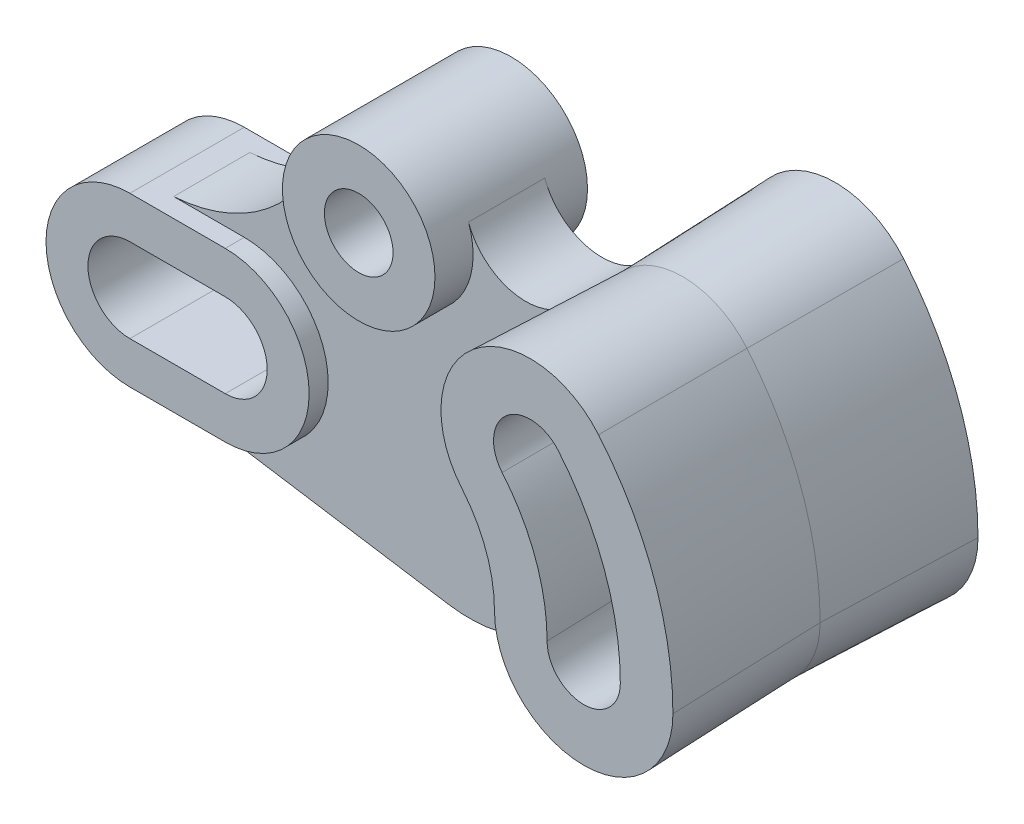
from build123d import *

# Parameters (mm, degrees)
EXTRUDE1_DEPTH           = 10
EXTRUDE2_DEPTH           = 15
SKETCH1_4_R              = 20.00000000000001
SKETCH1_4_R_2            = 9.000000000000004
EXTRUDE3_DEPTH           = 20
EXTRUDE4_DEPTH           = 40
EXTRUDE4_TAPER           = -2.0000000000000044
EXTRUDE4_OTHER_WAY_DEPTH = 40
EXTRUDE4_OTHER_WAY_TAPER = -2.0000000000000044


with BuildPart() as part:
    # Sketch1 → Extrude1 (new, symmetric)
    with BuildSketch(Plane.XY):
        with BuildLine():
            ThreePointArc((33.29855758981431, 53.595052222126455), (18.60703117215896, 31.598092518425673), (-6.042183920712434, 21.999999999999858))
            Line((-6.042183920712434, 21.999999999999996), (12.5, 21.999999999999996))
            ThreePointArc((12.5, 21.999999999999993), (34.49999999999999, 8.45e-15), (12.500000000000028, -22.000000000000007))
            Line((12.500000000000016, -22.000000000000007), (-12.499999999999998, -22.000000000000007))
            ThreePointArc((-12.499999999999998, -22.000000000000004), (-14.207531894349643, -21.93363478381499), (-15.904761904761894, -21.734939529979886))
            Line((-15.904761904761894, -21.734939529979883), (66.08333333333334, -34.57831288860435))
            ThreePointArc((66.08333333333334, -34.57831288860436), (84.07421218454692, -32.66326970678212), (98.70506535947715, -22.020091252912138))
            ThreePointArc((98.70506535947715, -22.020091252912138), (108.55346962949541, -16.297142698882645), (119.71359649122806, -18.576347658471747))
            ThreePointArc((119.71359649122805, -18.576347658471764), (112.2217625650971, -10.599507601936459), (109.5, 3.6e-15))
            ThreePointArc((109.5, 4.57e-15), (107.20831958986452, 12.99676544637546), (100.60968883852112, 24.425929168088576))
            ThreePointArc((100.60968883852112, 24.425929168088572), (95.4839596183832, 37.59955829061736), (99.432058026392, 51.17269806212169))
            ThreePointArc((99.43205802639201, 51.17269806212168), (84.24275973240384, 44.47556083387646), (71.28827120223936, 54.85571770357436))
            ThreePointArc((71.28827120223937, 54.85571770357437), (72.19473818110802, 51.48098951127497), (72.50000000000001, 48))
            ThreePointArc((72.50000000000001, 47.99999999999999), (49.67412387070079, 28.200645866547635), (33.298557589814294, 53.59505222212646))
        make_face()
    extrude(amount=EXTRUDE1_DEPTH, both=True)

    # Sketch1_3 → Extrude2 (add, symmetric)
    with BuildSketch(Plane.XY):
        with BuildLine():
            Line((-12.5, 21.999999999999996), (12.5, 21.999999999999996))
            ThreePointArc((12.5, 21.999999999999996), (34.49999999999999, 7.47e-15), (12.500000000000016, -22.000000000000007))
            Line((12.500000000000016, -22.000000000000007), (-12.499999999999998, -22.000000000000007))
            ThreePointArc((-12.499999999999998, -22.000000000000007), (-34.49999999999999, -4.99e-15), (-12.5, 21.999999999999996))
        make_face()
        with BuildLine():
            Line((-12.5, 10.999999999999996), (12.5, 10.999999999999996))
            ThreePointArc((12.5, 10.999999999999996), (23.49999999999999, -2.3e-15), (12.5, -11.000000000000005))
            Line((12.5, -11.000000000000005), (-12.5, -11.000000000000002))
            ThreePointArc((-12.5, -11.000000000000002), (-23.499999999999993, -3.64e-15), (-12.5, 10.999999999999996))
        make_face(mode=Mode.SUBTRACT)
    extrude(amount=EXTRUDE2_DEPTH, both=True)

    # Sketch1_4 → Extrude3 (add, symmetric)
    with BuildSketch(Plane.XY):
        with Locations((52.5, 48)):
            Circle(SKETCH1_4_R)
        with Locations((52.5, 48)):
            Circle(SKETCH1_4_R_2, mode=Mode.SUBTRACT)
    extrude(amount=EXTRUDE3_DEPTH, both=True)

    # Sketch1_5 → Extrude4 (add)
    with BuildSketch(Plane.XY):
        with BuildLine():
            ThreePointArc((153.50000000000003, -5.41e-15), (148.5547949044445, 28.04565175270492), (134.3156443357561, 52.70858399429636))
            ThreePointArc((134.3156443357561, 52.70858399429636), (103.32133917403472, 55.42023432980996), (100.60968883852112, 24.425929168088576))
            ThreePointArc((100.60968883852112, 24.425929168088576), (107.20831958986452, 12.996765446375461), (109.50000000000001, 4.57e-15))
            ThreePointArc((109.50000000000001, 4.57e-15), (131.5, -22.00000000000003), (153.50000000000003, -5.41e-15))
        make_face()
        with BuildLine():
            ThreePointArc((125.88915546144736, 45.63792028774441), (110.39200288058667, 46.99374545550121), (109.03617771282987, 31.496592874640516))
            ThreePointArc((109.03617771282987, 31.496592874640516), (117.5449384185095, 16.758987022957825), (120.50000000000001, 2.08e-15))
            ThreePointArc((120.50000000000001, 2.08e-15), (131.5, -11.000000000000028), (142.50000000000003, -2.91e-15))
            ThreePointArc((142.50000000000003, -2.91e-15), (138.2181760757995, 24.283430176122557), (125.88915546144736, 45.63792028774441))
        make_face(mode=Mode.SUBTRACT)
    extrude(amount=EXTRUDE4_DEPTH, taper=EXTRUDE4_TAPER)

    # Sketch1_5 → Extrude4 other way (add)
    with BuildSketch(Plane.XY):
        with BuildLine():
            ThreePointArc((153.50000000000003, -5.41e-15), (148.5547949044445, 28.04565175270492), (134.3156443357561, 52.70858399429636))
            ThreePointArc((134.3156443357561, 52.70858399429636), (103.32133917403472, 55.42023432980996), (100.60968883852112, 24.425929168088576))
            ThreePointArc((100.60968883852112, 24.425929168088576), (107.20831958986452, 12.996765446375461), (109.50000000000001, 4.57e-15))
            ThreePointArc((109.50000000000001, 4.57e-15), (131.5, -22.00000000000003), (153.50000000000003, -5.41e-15))
        make_face()
        with BuildLine():
            ThreePointArc((125.88915546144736, 45.63792028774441), (110.39200288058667, 46.99374545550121), (109.03617771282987, 31.496592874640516))
            ThreePointArc((109.03617771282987, 31.496592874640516), (117.5449384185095, 16.758987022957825), (120.50000000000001, 2.08e-15))
            ThreePointArc((120.50000000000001, 2.08e-15), (131.5, -11.000000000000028), (142.50000000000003, -2.91e-15))
            ThreePointArc((142.50000000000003, -2.91e-15), (138.2181760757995, 24.283430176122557), (125.88915546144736, 45.63792028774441))
        make_face(mode=Mode.SUBTRACT)
    extrude(amount=-EXTRUDE4_OTHER_WAY_DEPTH, taper=EXTRUDE4_OTHER_WAY_TAPER)


solid = part.part
